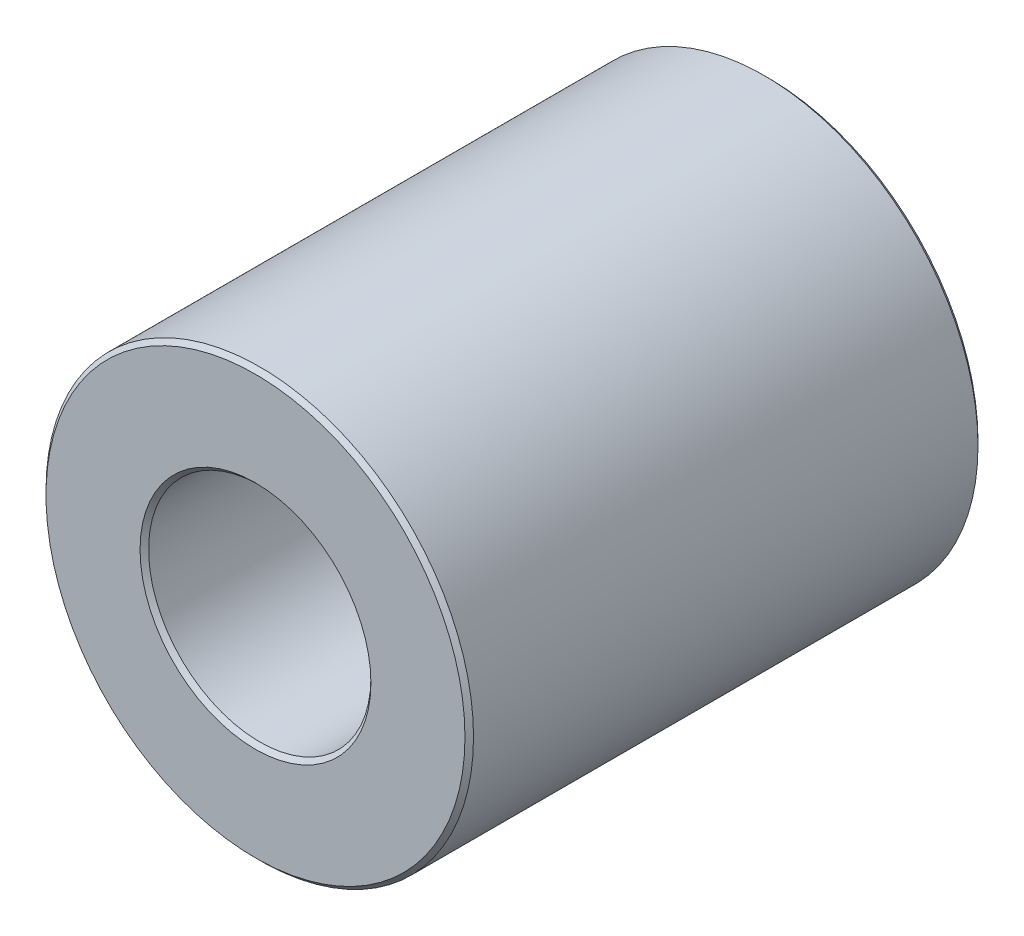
ISO-10303-21;
HEADER;
FILE_DESCRIPTION(('STEP AP214'),'2;1');
FILE_NAME('part.step','',(''),(''),'','','');
FILE_SCHEMA(('AUTOMOTIVE_DESIGN { 1 0 10303 214 1 1 1 1 }'));
ENDSEC;
DATA;
#1=APPLICATION_CONTEXT('core data for automotive mechanical design processes');
#2=APPLICATION_PROTOCOL_DEFINITION('international standard','automotive_design',2000,#1);
#3=PRODUCT_CONTEXT('',#1,'mechanical');
#4=PRODUCT('Part','Part','',(#3));
#5=PRODUCT_RELATED_PRODUCT_CATEGORY('part','',(#4));
#6=PRODUCT_DEFINITION_FORMATION('','',#4);
#7=PRODUCT_DEFINITION_CONTEXT('part definition',#1,'design');
#8=PRODUCT_DEFINITION('design','',#6,#7);
#9=PRODUCT_DEFINITION_SHAPE('','',#8);
#10=(LENGTH_UNIT() NAMED_UNIT(*) SI_UNIT(.MILLI.,.METRE.));
#11=(NAMED_UNIT(*) PLANE_ANGLE_UNIT() SI_UNIT($,.RADIAN.));
#12=(NAMED_UNIT(*) SI_UNIT($,.STERADIAN.) SOLID_ANGLE_UNIT());
#13=UNCERTAINTY_MEASURE_WITH_UNIT(LENGTH_MEASURE(1.E-05),#10,'distance_accuracy_value','');
#14=(GEOMETRIC_REPRESENTATION_CONTEXT(3) GLOBAL_UNCERTAINTY_ASSIGNED_CONTEXT((#13)) GLOBAL_UNIT_ASSIGNED_CONTEXT((#10,
#11,#12)) REPRESENTATION_CONTEXT('',''));
#15=CARTESIAN_POINT('',(0.,0.,0.));
#16=DIRECTION('',(0.,0.,1.));
#17=DIRECTION('',(1.,0.,0.));
#18=AXIS2_PLACEMENT_3D('',#15,#16,#17);
#19=CARTESIAN_POINT('',(0.,0.,6.));
#20=DIRECTION('',(0.,0.,1.));
#21=DIRECTION('',(1.,0.,0.));
#22=AXIS2_PLACEMENT_3D('',#19,#20,#21);
#23=PLANE('',#22);
#24=CARTESIAN_POINT('',(0.,0.,6.));
#25=DIRECTION('',(0.,0.,1.));
#26=DIRECTION('',(1.,0.,0.));
#27=AXIS2_PLACEMENT_3D('',#24,#25,#26);
#28=CIRCLE('',#27,2.7);
#29=CARTESIAN_POINT('',(2.7,0.,6.));
#30=VERTEX_POINT('',#29);
#31=EDGE_CURVE('E10',#30,#30,#28,.F.);
#32=ORIENTED_EDGE('',*,*,#31,.T.);
#33=EDGE_LOOP('',(#32));
#34=FACE_BOUND('',#33,.T.);
#35=CARTESIAN_POINT('',(0.,0.,6.));
#36=DIRECTION('',(0.,0.,1.));
#37=DIRECTION('',(1.,0.,0.));
#38=AXIS2_PLACEMENT_3D('',#35,#36,#37);
#39=CIRCLE('',#38,4.9);
#40=CARTESIAN_POINT('',(4.9,0.,6.));
#41=VERTEX_POINT('',#40);
#42=EDGE_CURVE('E45',#41,#41,#39,.T.);
#43=ORIENTED_EDGE('',*,*,#42,.T.);
#44=EDGE_LOOP('',(#43));
#45=FACE_BOUND('',#44,.T.);
#46=ADVANCED_FACE('F37',(#34,#45),#23,.T.);
#47=CARTESIAN_POINT('',(0.,0.,-6.));
#48=DIRECTION('',(0.,0.,1.));
#49=DIRECTION('',(1.,0.,0.));
#50=AXIS2_PLACEMENT_3D('',#47,#48,#49);
#51=PLANE('',#50);
#52=CARTESIAN_POINT('',(0.,0.,-6.));
#53=DIRECTION('',(0.,0.,1.));
#54=DIRECTION('',(1.,0.,0.));
#55=AXIS2_PLACEMENT_3D('',#52,#53,#54);
#56=CIRCLE('',#55,4.9);
#57=CARTESIAN_POINT('',(4.9,0.,-6.));
#58=VERTEX_POINT('',#57);
#59=EDGE_CURVE('E64',#58,#58,#56,.F.);
#60=ORIENTED_EDGE('',*,*,#59,.T.);
#61=EDGE_LOOP('',(#60));
#62=FACE_BOUND('',#61,.T.);
#63=CARTESIAN_POINT('',(0.,0.,-6.));
#64=DIRECTION('',(0.,0.,1.));
#65=DIRECTION('',(1.,0.,0.));
#66=AXIS2_PLACEMENT_3D('',#63,#64,#65);
#67=CIRCLE('',#66,2.7);
#68=CARTESIAN_POINT('',(2.7,0.,-6.));
#69=VERTEX_POINT('',#68);
#70=EDGE_CURVE('E67',#69,#69,#67,.T.);
#71=ORIENTED_EDGE('',*,*,#70,.T.);
#72=EDGE_LOOP('',(#71));
#73=FACE_BOUND('',#72,.T.);
#74=ADVANCED_FACE('F89',(#62,#73),#51,.F.);
#75=CARTESIAN_POINT('',(0.,0.,6.));
#76=DIRECTION('',(0.,0.,-1.));
#77=DIRECTION('',(-1.,0.,0.));
#78=AXIS2_PLACEMENT_3D('',#75,#76,#77);
#79=CYLINDRICAL_SURFACE('',#78,5.);
#80=CARTESIAN_POINT('',(0.,0.,-5.9));
#81=DIRECTION('',(0.,0.,1.));
#82=DIRECTION('',(1.,0.,0.));
#83=AXIS2_PLACEMENT_3D('',#80,#81,#82);
#84=CIRCLE('',#83,5.);
#85=CARTESIAN_POINT('',(5.,0.,-5.9));
#86=VERTEX_POINT('',#85);
#87=EDGE_CURVE('E70',#86,#86,#84,.T.);
#88=ORIENTED_EDGE('',*,*,#87,.T.);
#89=EDGE_LOOP('',(#88));
#90=FACE_BOUND('',#89,.T.);
#91=CARTESIAN_POINT('',(0.,0.,5.9));
#92=DIRECTION('',(0.,0.,1.));
#93=DIRECTION('',(1.,0.,0.));
#94=AXIS2_PLACEMENT_3D('',#91,#92,#93);
#95=CIRCLE('',#94,5.);
#96=CARTESIAN_POINT('',(5.,0.,5.9));
#97=VERTEX_POINT('',#96);
#98=EDGE_CURVE('E73',#97,#97,#95,.F.);
#99=ORIENTED_EDGE('',*,*,#98,.T.);
#100=EDGE_LOOP('',(#99));
#101=FACE_BOUND('',#100,.T.);
#102=ADVANCED_FACE('F78',(#90,#101),#79,.T.);
#103=CARTESIAN_POINT('',(0.,0.,6.));
#104=DIRECTION('',(0.,0.,-1.));
#105=DIRECTION('',(-1.,0.,0.));
#106=AXIS2_PLACEMENT_3D('',#103,#104,#105);
#107=CYLINDRICAL_SURFACE('',#106,2.6);
#108=CARTESIAN_POINT('',(0.,0.,-5.9));
#109=DIRECTION('',(0.,0.,1.));
#110=DIRECTION('',(1.,0.,0.));
#111=AXIS2_PLACEMENT_3D('',#108,#109,#110);
#112=CIRCLE('',#111,2.6);
#113=CARTESIAN_POINT('',(2.6,0.,-5.9));
#114=VERTEX_POINT('',#113);
#115=EDGE_CURVE('E52',#114,#114,#112,.F.);
#116=ORIENTED_EDGE('',*,*,#115,.T.);
#117=EDGE_LOOP('',(#116));
#118=FACE_BOUND('',#117,.T.);
#119=CARTESIAN_POINT('',(0.,0.,5.9));
#120=DIRECTION('',(0.,0.,1.));
#121=DIRECTION('',(1.,0.,0.));
#122=AXIS2_PLACEMENT_3D('',#119,#120,#121);
#123=CIRCLE('',#122,2.6);
#124=CARTESIAN_POINT('',(2.6,0.,5.9));
#125=VERTEX_POINT('',#124);
#126=EDGE_CURVE('E59',#125,#125,#123,.T.);
#127=ORIENTED_EDGE('',*,*,#126,.T.);
#128=EDGE_LOOP('',(#127));
#129=FACE_BOUND('',#128,.T.);
#130=ADVANCED_FACE('F97',(#118,#129),#107,.F.);
#131=CARTESIAN_POINT('',(0.,0.,-5.9));
#132=DIRECTION('',(0.,0.,1.));
#133=DIRECTION('',(1.,0.,0.));
#134=AXIS2_PLACEMENT_3D('',#131,#132,#133);
#135=CONICAL_SURFACE('',#134,5.,0.785398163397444);
#136=ORIENTED_EDGE('',*,*,#59,.F.);
#137=EDGE_LOOP('',(#136));
#138=FACE_BOUND('',#137,.T.);
#139=ORIENTED_EDGE('',*,*,#87,.F.);
#140=EDGE_LOOP('',(#139));
#141=FACE_BOUND('',#140,.T.);
#142=ADVANCED_FACE('F102',(#138,#141),#135,.T.);
#143=CARTESIAN_POINT('',(0.,0.,-6.));
#144=DIRECTION('',(0.,0.,-1.));
#145=DIRECTION('',(-1.,0.,0.));
#146=AXIS2_PLACEMENT_3D('',#143,#144,#145);
#147=CONICAL_SURFACE('',#146,2.7,0.78539816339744);
#148=ORIENTED_EDGE('',*,*,#115,.F.);
#149=EDGE_LOOP('',(#148));
#150=FACE_BOUND('',#149,.T.);
#151=ORIENTED_EDGE('',*,*,#70,.F.);
#152=EDGE_LOOP('',(#151));
#153=FACE_BOUND('',#152,.T.);
#154=ADVANCED_FACE('F86',(#150,#153),#147,.F.);
#155=CARTESIAN_POINT('',(0.,0.,5.9));
#156=DIRECTION('',(0.,0.,1.));
#157=DIRECTION('',(1.,0.,0.));
#158=AXIS2_PLACEMENT_3D('',#155,#156,#157);
#159=CONICAL_SURFACE('',#158,2.6,0.78539816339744);
#160=ORIENTED_EDGE('',*,*,#31,.F.);
#161=EDGE_LOOP('',(#160));
#162=FACE_BOUND('',#161,.T.);
#163=ORIENTED_EDGE('',*,*,#126,.F.);
#164=EDGE_LOOP('',(#163));
#165=FACE_BOUND('',#164,.T.);
#166=ADVANCED_FACE('F82',(#162,#165),#159,.F.);
#167=CARTESIAN_POINT('',(0.,0.,6.));
#168=DIRECTION('',(0.,0.,-1.));
#169=DIRECTION('',(-1.,0.,0.));
#170=AXIS2_PLACEMENT_3D('',#167,#168,#169);
#171=CONICAL_SURFACE('',#170,4.9,0.785398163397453);
#172=ORIENTED_EDGE('',*,*,#98,.F.);
#173=EDGE_LOOP('',(#172));
#174=FACE_BOUND('',#173,.T.);
#175=ORIENTED_EDGE('',*,*,#42,.F.);
#176=EDGE_LOOP('',(#175));
#177=FACE_BOUND('',#176,.T.);
#178=ADVANCED_FACE('F39',(#174,#177),#171,.T.);
#179=CLOSED_SHELL('',(#46,#74,#102,#130,#142,#154,#166,#178));
#180=MANIFOLD_SOLID_BREP('B2',#179);
#181=ADVANCED_BREP_SHAPE_REPRESENTATION('',(#18,#180),#14);
#182=SHAPE_DEFINITION_REPRESENTATION(#9,#181);
ENDSEC;
END-ISO-10303-21;
